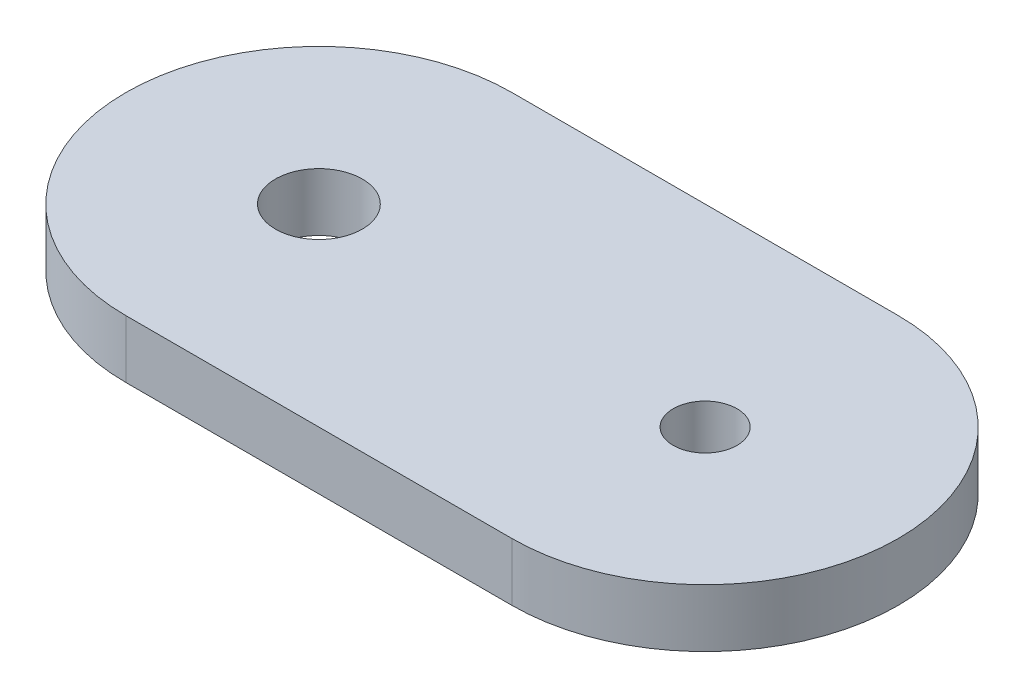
ISO-10303-21;
HEADER;
FILE_DESCRIPTION(('STEP AP214'),'2;1');
FILE_NAME('part.step','',(''),(''),'','','');
FILE_SCHEMA(('AUTOMOTIVE_DESIGN { 1 0 10303 214 1 1 1 1 }'));
ENDSEC;
DATA;
#1=APPLICATION_CONTEXT('core data for automotive mechanical design processes');
#2=APPLICATION_PROTOCOL_DEFINITION('international standard','automotive_design',2000,#1);
#3=PRODUCT_CONTEXT('',#1,'mechanical');
#4=PRODUCT('Part','Part','',(#3));
#5=PRODUCT_RELATED_PRODUCT_CATEGORY('part','',(#4));
#6=PRODUCT_DEFINITION_FORMATION('','',#4);
#7=PRODUCT_DEFINITION_CONTEXT('part definition',#1,'design');
#8=PRODUCT_DEFINITION('design','',#6,#7);
#9=PRODUCT_DEFINITION_SHAPE('','',#8);
#10=(LENGTH_UNIT() NAMED_UNIT(*) SI_UNIT(.MILLI.,.METRE.));
#11=(NAMED_UNIT(*) PLANE_ANGLE_UNIT() SI_UNIT($,.RADIAN.));
#12=(NAMED_UNIT(*) SI_UNIT($,.STERADIAN.) SOLID_ANGLE_UNIT());
#13=UNCERTAINTY_MEASURE_WITH_UNIT(LENGTH_MEASURE(1.E-05),#10,'distance_accuracy_value','');
#14=(GEOMETRIC_REPRESENTATION_CONTEXT(3) GLOBAL_UNCERTAINTY_ASSIGNED_CONTEXT((#13)) GLOBAL_UNIT_ASSIGNED_CONTEXT((#10,
#11,#12)) REPRESENTATION_CONTEXT('',''));
#15=CARTESIAN_POINT('',(0.,0.,0.));
#16=DIRECTION('',(0.,0.,1.));
#17=DIRECTION('',(1.,0.,0.));
#18=AXIS2_PLACEMENT_3D('',#15,#16,#17);
#19=CARTESIAN_POINT('',(0.,3.,0.));
#20=DIRECTION('',(0.,-1.,0.));
#21=DIRECTION('',(0.,0.,-1.));
#22=AXIS2_PLACEMENT_3D('',#19,#20,#21);
#23=CYLINDRICAL_SURFACE('',#22,10.);
#24=CARTESIAN_POINT('',(0.,0.,0.));
#25=DIRECTION('',(0.,1.,0.));
#26=DIRECTION('',(0.,0.,1.));
#27=AXIS2_PLACEMENT_3D('',#24,#25,#26);
#28=CIRCLE('',#27,10.);
#29=CARTESIAN_POINT('',(0.,0.,-10.));
#30=VERTEX_POINT('',#29);
#31=CARTESIAN_POINT('',(0.,0.,10.));
#32=VERTEX_POINT('',#31);
#33=EDGE_CURVE('E98',#30,#32,#28,.T.);
#34=ORIENTED_EDGE('',*,*,#33,.T.);
#35=DIRECTION('',(0.,-1.,0.));
#36=VECTOR('',#35,1.);
#37=CARTESIAN_POINT('',(0.,3.,10.));
#38=LINE('',#37,#36);
#39=CARTESIAN_POINT('',(0.,3.,10.));
#40=VERTEX_POINT('',#39);
#41=EDGE_CURVE('E11',#40,#32,#38,.T.);
#42=ORIENTED_EDGE('',*,*,#41,.F.);
#43=CARTESIAN_POINT('',(0.,3.,0.));
#44=DIRECTION('',(0.,1.,0.));
#45=DIRECTION('',(0.,0.,1.));
#46=AXIS2_PLACEMENT_3D('',#43,#44,#45);
#47=CIRCLE('',#46,10.);
#48=CARTESIAN_POINT('',(0.,3.,-10.));
#49=VERTEX_POINT('',#48);
#50=EDGE_CURVE('E86',#49,#40,#47,.T.);
#51=ORIENTED_EDGE('',*,*,#50,.F.);
#52=DIRECTION('',(0.,-1.,0.));
#53=VECTOR('',#52,1.);
#54=CARTESIAN_POINT('',(0.,3.,-10.));
#55=LINE('',#54,#53);
#56=EDGE_CURVE('E94',#49,#30,#55,.T.);
#57=ORIENTED_EDGE('',*,*,#56,.T.);
#58=EDGE_LOOP('',(#34,#42,#51,#57));
#59=FACE_BOUND('',#58,.T.);
#60=ADVANCED_FACE('F35',(#59),#23,.T.);
#61=CARTESIAN_POINT('',(20.,3.,10.));
#62=DIRECTION('',(0.,0.,-1.));
#63=DIRECTION('',(-1.,0.,0.));
#64=AXIS2_PLACEMENT_3D('',#61,#62,#63);
#65=PLANE('',#64);
#66=DIRECTION('',(1.,0.,0.));
#67=VECTOR('',#66,1.);
#68=CARTESIAN_POINT('',(20.,0.,10.));
#69=LINE('',#68,#67);
#70=CARTESIAN_POINT('',(20.,0.,10.));
#71=VERTEX_POINT('',#70);
#72=EDGE_CURVE('E90',#32,#71,#69,.T.);
#73=ORIENTED_EDGE('',*,*,#72,.T.);
#74=DIRECTION('',(0.,-1.,0.));
#75=VECTOR('',#74,1.);
#76=CARTESIAN_POINT('',(20.,3.,10.));
#77=LINE('',#76,#75);
#78=CARTESIAN_POINT('',(20.,3.,10.));
#79=VERTEX_POINT('',#78);
#80=EDGE_CURVE('E43',#79,#71,#77,.T.);
#81=ORIENTED_EDGE('',*,*,#80,.F.);
#82=DIRECTION('',(1.,0.,0.));
#83=VECTOR('',#82,1.);
#84=CARTESIAN_POINT('',(20.,3.,10.));
#85=LINE('',#84,#83);
#86=EDGE_CURVE('E81',#40,#79,#85,.T.);
#87=ORIENTED_EDGE('',*,*,#86,.F.);
#88=ORIENTED_EDGE('',*,*,#41,.T.);
#89=EDGE_LOOP('',(#73,#81,#87,#88));
#90=FACE_BOUND('',#89,.T.);
#91=ADVANCED_FACE('F89',(#90),#65,.F.);
#92=CARTESIAN_POINT('',(20.,3.,0.));
#93=DIRECTION('',(0.,-1.,0.));
#94=DIRECTION('',(0.,0.,-1.));
#95=AXIS2_PLACEMENT_3D('',#92,#93,#94);
#96=CYLINDRICAL_SURFACE('',#95,10.);
#97=CARTESIAN_POINT('',(20.,0.,0.));
#98=DIRECTION('',(0.,1.,0.));
#99=DIRECTION('',(0.,0.,1.));
#100=AXIS2_PLACEMENT_3D('',#97,#98,#99);
#101=CIRCLE('',#100,10.);
#102=CARTESIAN_POINT('',(20.,0.,-10.));
#103=VERTEX_POINT('',#102);
#104=EDGE_CURVE('E68',#71,#103,#101,.T.);
#105=ORIENTED_EDGE('',*,*,#104,.T.);
#106=DIRECTION('',(0.,-1.,0.));
#107=VECTOR('',#106,1.);
#108=CARTESIAN_POINT('',(20.,3.,-10.));
#109=LINE('',#108,#107);
#110=CARTESIAN_POINT('',(20.,3.,-10.));
#111=VERTEX_POINT('',#110);
#112=EDGE_CURVE('E91',#111,#103,#109,.T.);
#113=ORIENTED_EDGE('',*,*,#112,.F.);
#114=CARTESIAN_POINT('',(20.,3.,0.));
#115=DIRECTION('',(0.,1.,0.));
#116=DIRECTION('',(0.,0.,1.));
#117=AXIS2_PLACEMENT_3D('',#114,#115,#116);
#118=CIRCLE('',#117,10.);
#119=EDGE_CURVE('E84',#79,#111,#118,.T.);
#120=ORIENTED_EDGE('',*,*,#119,.F.);
#121=ORIENTED_EDGE('',*,*,#80,.T.);
#122=EDGE_LOOP('',(#105,#113,#120,#121));
#123=FACE_BOUND('',#122,.T.);
#124=ADVANCED_FACE('F92',(#123),#96,.T.);
#125=CARTESIAN_POINT('',(0.,3.,-10.));
#126=DIRECTION('',(0.,0.,1.));
#127=DIRECTION('',(1.,0.,0.));
#128=AXIS2_PLACEMENT_3D('',#125,#126,#127);
#129=PLANE('',#128);
#130=DIRECTION('',(-1.,0.,0.));
#131=VECTOR('',#130,1.);
#132=CARTESIAN_POINT('',(0.,0.,-10.));
#133=LINE('',#132,#131);
#134=EDGE_CURVE('E74',#103,#30,#133,.T.);
#135=ORIENTED_EDGE('',*,*,#134,.T.);
#136=ORIENTED_EDGE('',*,*,#56,.F.);
#137=DIRECTION('',(-1.,0.,0.));
#138=VECTOR('',#137,1.);
#139=CARTESIAN_POINT('',(0.,3.,-10.));
#140=LINE('',#139,#138);
#141=EDGE_CURVE('E51',#111,#49,#140,.T.);
#142=ORIENTED_EDGE('',*,*,#141,.F.);
#143=ORIENTED_EDGE('',*,*,#112,.T.);
#144=EDGE_LOOP('',(#135,#136,#142,#143));
#145=FACE_BOUND('',#144,.T.);
#146=ADVANCED_FACE('F106',(#145),#129,.F.);
#147=CARTESIAN_POINT('',(0.,3.,0.));
#148=DIRECTION('',(0.,1.,0.));
#149=DIRECTION('',(0.,0.,1.));
#150=AXIS2_PLACEMENT_3D('',#147,#148,#149);
#151=PLANE('',#150);
#152=CARTESIAN_POINT('',(0.,3.,0.));
#153=DIRECTION('',(0.,1.,0.));
#154=DIRECTION('',(0.,0.,1.));
#155=AXIS2_PLACEMENT_3D('',#152,#153,#154);
#156=CIRCLE('',#155,2.25);
#157=CARTESIAN_POINT('',(0.,3.,2.25));
#158=VERTEX_POINT('',#157);
#159=EDGE_CURVE('E120',#158,#158,#156,.T.);
#160=ORIENTED_EDGE('',*,*,#159,.F.);
#161=EDGE_LOOP('',(#160));
#162=FACE_BOUND('',#161,.T.);
#163=CARTESIAN_POINT('',(20.,3.,0.));
#164=DIRECTION('',(0.,1.,0.));
#165=DIRECTION('',(0.,0.,1.));
#166=AXIS2_PLACEMENT_3D('',#163,#164,#165);
#167=CIRCLE('',#166,1.64999999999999);
#168=CARTESIAN_POINT('',(20.,3.,1.64999999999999));
#169=VERTEX_POINT('',#168);
#170=EDGE_CURVE('E114',#169,#169,#167,.T.);
#171=ORIENTED_EDGE('',*,*,#170,.F.);
#172=EDGE_LOOP('',(#171));
#173=FACE_BOUND('',#172,.T.);
#174=ORIENTED_EDGE('',*,*,#50,.T.);
#175=ORIENTED_EDGE('',*,*,#86,.T.);
#176=ORIENTED_EDGE('',*,*,#119,.T.);
#177=ORIENTED_EDGE('',*,*,#141,.T.);
#178=EDGE_LOOP('',(#174,#175,#176,#177));
#179=FACE_BOUND('',#178,.T.);
#180=ADVANCED_FACE('F82',(#162,#173,#179),#151,.T.);
#181=CARTESIAN_POINT('',(0.,0.,0.));
#182=DIRECTION('',(0.,1.,0.));
#183=DIRECTION('',(0.,0.,1.));
#184=AXIS2_PLACEMENT_3D('',#181,#182,#183);
#185=PLANE('',#184);
#186=CARTESIAN_POINT('',(0.,0.,0.));
#187=DIRECTION('',(0.,1.,0.));
#188=DIRECTION('',(0.,0.,1.));
#189=AXIS2_PLACEMENT_3D('',#186,#187,#188);
#190=CIRCLE('',#189,2.25);
#191=CARTESIAN_POINT('',(0.,0.,2.25));
#192=VERTEX_POINT('',#191);
#193=EDGE_CURVE('E117',#192,#192,#190,.T.);
#194=ORIENTED_EDGE('',*,*,#193,.T.);
#195=EDGE_LOOP('',(#194));
#196=FACE_BOUND('',#195,.T.);
#197=CARTESIAN_POINT('',(20.,0.,0.));
#198=DIRECTION('',(0.,1.,0.));
#199=DIRECTION('',(0.,0.,1.));
#200=AXIS2_PLACEMENT_3D('',#197,#198,#199);
#201=CIRCLE('',#200,1.65);
#202=CARTESIAN_POINT('',(20.,0.,1.65));
#203=VERTEX_POINT('',#202);
#204=EDGE_CURVE('E101',#203,#203,#201,.T.);
#205=ORIENTED_EDGE('',*,*,#204,.T.);
#206=EDGE_LOOP('',(#205));
#207=FACE_BOUND('',#206,.T.);
#208=ORIENTED_EDGE('',*,*,#33,.F.);
#209=ORIENTED_EDGE('',*,*,#134,.F.);
#210=ORIENTED_EDGE('',*,*,#104,.F.);
#211=ORIENTED_EDGE('',*,*,#72,.F.);
#212=EDGE_LOOP('',(#208,#209,#210,#211));
#213=FACE_BOUND('',#212,.T.);
#214=ADVANCED_FACE('F109',(#196,#207,#213),#185,.F.);
#215=CARTESIAN_POINT('',(20.,3.,0.));
#216=DIRECTION('',(0.,1.,0.));
#217=DIRECTION('',(0.,0.,1.));
#218=AXIS2_PLACEMENT_3D('',#215,#216,#217);
#219=CYLINDRICAL_SURFACE('',#218,1.64999999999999);
#220=ORIENTED_EDGE('',*,*,#204,.F.);
#221=EDGE_LOOP('',(#220));
#222=FACE_BOUND('',#221,.T.);
#223=ORIENTED_EDGE('',*,*,#170,.T.);
#224=EDGE_LOOP('',(#223));
#225=FACE_BOUND('',#224,.T.);
#226=ADVANCED_FACE('F131',(#222,#225),#219,.F.);
#227=CARTESIAN_POINT('',(0.,3.,0.));
#228=DIRECTION('',(0.,1.,0.));
#229=DIRECTION('',(0.,0.,1.));
#230=AXIS2_PLACEMENT_3D('',#227,#228,#229);
#231=CYLINDRICAL_SURFACE('',#230,2.25);
#232=ORIENTED_EDGE('',*,*,#193,.F.);
#233=EDGE_LOOP('',(#232));
#234=FACE_BOUND('',#233,.T.);
#235=ORIENTED_EDGE('',*,*,#159,.T.);
#236=EDGE_LOOP('',(#235));
#237=FACE_BOUND('',#236,.T.);
#238=ADVANCED_FACE('F124',(#234,#237),#231,.F.);
#239=CLOSED_SHELL('',(#60,#91,#124,#146,#180,#214,#226,#238));
#240=MANIFOLD_SOLID_BREP('B2',#239);
#241=ADVANCED_BREP_SHAPE_REPRESENTATION('',(#18,#240),#14);
#242=SHAPE_DEFINITION_REPRESENTATION(#9,#241);
ENDSEC;
END-ISO-10303-21;
